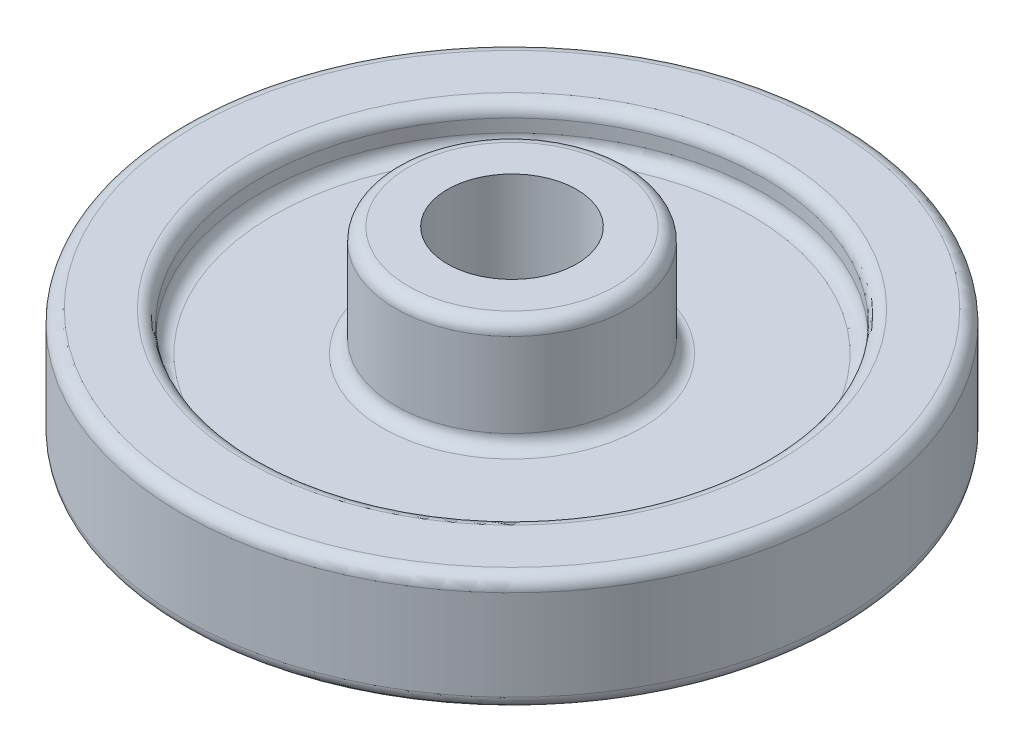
ISO-10303-21;
HEADER;
FILE_DESCRIPTION(('STEP AP214'),'2;1');
FILE_NAME('part.step','',(''),(''),'','','');
FILE_SCHEMA(('AUTOMOTIVE_DESIGN { 1 0 10303 214 1 1 1 1 }'));
ENDSEC;
DATA;
#1=APPLICATION_CONTEXT('core data for automotive mechanical design processes');
#2=APPLICATION_PROTOCOL_DEFINITION('international standard','automotive_design',2000,#1);
#3=PRODUCT_CONTEXT('',#1,'mechanical');
#4=PRODUCT('Part','Part','',(#3));
#5=PRODUCT_RELATED_PRODUCT_CATEGORY('part','',(#4));
#6=PRODUCT_DEFINITION_FORMATION('','',#4);
#7=PRODUCT_DEFINITION_CONTEXT('part definition',#1,'design');
#8=PRODUCT_DEFINITION('design','',#6,#7);
#9=PRODUCT_DEFINITION_SHAPE('','',#8);
#10=(LENGTH_UNIT() NAMED_UNIT(*) SI_UNIT(.MILLI.,.METRE.));
#11=(NAMED_UNIT(*) PLANE_ANGLE_UNIT() SI_UNIT($,.RADIAN.));
#12=(NAMED_UNIT(*) SI_UNIT($,.STERADIAN.) SOLID_ANGLE_UNIT());
#13=UNCERTAINTY_MEASURE_WITH_UNIT(LENGTH_MEASURE(1.E-05),#10,'distance_accuracy_value','');
#14=(GEOMETRIC_REPRESENTATION_CONTEXT(3) GLOBAL_UNCERTAINTY_ASSIGNED_CONTEXT((#13)) GLOBAL_UNIT_ASSIGNED_CONTEXT((#10,
#11,#12)) REPRESENTATION_CONTEXT('',''));
#15=CARTESIAN_POINT('',(0.,0.,0.));
#16=DIRECTION('',(0.,0.,1.));
#17=DIRECTION('',(1.,0.,0.));
#18=AXIS2_PLACEMENT_3D('',#15,#16,#17);
#19=CARTESIAN_POINT('',(28.575,0.,0.));
#20=DIRECTION('',(0.,1.,0.));
#21=DIRECTION('',(0.,0.,1.));
#22=AXIS2_PLACEMENT_3D('',#19,#20,#21);
#23=PLANE('',#22);
#24=CARTESIAN_POINT('',(0.,0.,0.));
#25=DIRECTION('',(0.,-1.,0.));
#26=DIRECTION('',(0.,0.,-1.));
#27=AXIS2_PLACEMENT_3D('',#24,#25,#26);
#28=CIRCLE('',#27,15.875);
#29=CARTESIAN_POINT('',(0.,0.,-15.875));
#30=VERTEX_POINT('',#29);
#31=EDGE_CURVE('E93',#30,#30,#28,.T.);
#32=ORIENTED_EDGE('',*,*,#31,.F.);
#33=EDGE_LOOP('',(#32));
#34=FACE_BOUND('',#33,.T.);
#35=CARTESIAN_POINT('',(0.,0.,0.));
#36=DIRECTION('',(0.,-1.,0.));
#37=DIRECTION('',(0.,0.,-1.));
#38=AXIS2_PLACEMENT_3D('',#35,#36,#37);
#39=CIRCLE('',#38,28.575);
#40=CARTESIAN_POINT('',(0.,0.,-28.575));
#41=VERTEX_POINT('',#40);
#42=EDGE_CURVE('E10',#41,#41,#39,.T.);
#43=ORIENTED_EDGE('',*,*,#42,.T.);
#44=EDGE_LOOP('',(#43));
#45=FACE_BOUND('',#44,.T.);
#46=ADVANCED_FACE('F26',(#34,#45),#23,.F.);
#47=CARTESIAN_POINT('',(0.,0.,0.));
#48=DIRECTION('',(0.,-1.,0.));
#49=DIRECTION('',(0.,0.,-1.));
#50=AXIS2_PLACEMENT_3D('',#47,#48,#49);
#51=CYLINDRICAL_SURFACE('',#50,28.575);
#52=CARTESIAN_POINT('',(0.,6.34999999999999,0.));
#53=DIRECTION('',(0.,-1.,0.));
#54=DIRECTION('',(0.,0.,-1.));
#55=AXIS2_PLACEMENT_3D('',#52,#53,#54);
#56=CIRCLE('',#55,28.575);
#57=CARTESIAN_POINT('',(0.,6.34999999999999,-28.575));
#58=VERTEX_POINT('',#57);
#59=EDGE_CURVE('E32',#58,#58,#56,.T.);
#60=ORIENTED_EDGE('',*,*,#59,.T.);
#61=EDGE_LOOP('',(#60));
#62=FACE_BOUND('',#61,.T.);
#63=ORIENTED_EDGE('',*,*,#42,.F.);
#64=EDGE_LOOP('',(#63));
#65=FACE_BOUND('',#64,.T.);
#66=ADVANCED_FACE('F100',(#62,#65),#51,.T.);
#67=CARTESIAN_POINT('',(0.,6.35000000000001,0.));
#68=DIRECTION('',(0.,-1.,0.));
#69=DIRECTION('',(0.,0.,-1.));
#70=AXIS2_PLACEMENT_3D('',#67,#68,#69);
#71=TOROIDAL_SURFACE('',#70,31.75,3.175);
#72=ORIENTED_EDGE('',*,*,#59,.F.);
#73=EDGE_LOOP('',(#72));
#74=FACE_BOUND('',#73,.T.);
#75=CARTESIAN_POINT('',(0.,9.52500000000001,0.));
#76=DIRECTION('',(0.,-1.,0.));
#77=DIRECTION('',(0.,0.,-1.));
#78=AXIS2_PLACEMENT_3D('',#75,#76,#77);
#79=CIRCLE('',#78,31.75);
#80=CARTESIAN_POINT('',(0.,9.52500000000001,-31.75));
#81=VERTEX_POINT('',#80);
#82=EDGE_CURVE('E36',#81,#81,#79,.T.);
#83=ORIENTED_EDGE('',*,*,#82,.T.);
#84=EDGE_LOOP('',(#83));
#85=FACE_BOUND('',#84,.T.);
#86=ADVANCED_FACE('F104',(#74,#85),#71,.F.);
#87=CARTESIAN_POINT('',(31.75,9.52500000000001,0.));
#88=DIRECTION('',(0.,-1.,0.));
#89=DIRECTION('',(0.,0.,-1.));
#90=AXIS2_PLACEMENT_3D('',#87,#88,#89);
#91=PLANE('',#90);
#92=CARTESIAN_POINT('',(0.,9.52500000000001,0.));
#93=DIRECTION('',(0.,-1.,0.));
#94=DIRECTION('',(0.,0.,-1.));
#95=AXIS2_PLACEMENT_3D('',#92,#93,#94);
#96=CIRCLE('',#95,58.7375);
#97=CARTESIAN_POINT('',(0.,9.52500000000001,-58.7375));
#98=VERTEX_POINT('',#97);
#99=EDGE_CURVE('E40',#98,#98,#96,.T.);
#100=ORIENTED_EDGE('',*,*,#99,.T.);
#101=EDGE_LOOP('',(#100));
#102=FACE_BOUND('',#101,.T.);
#103=ORIENTED_EDGE('',*,*,#82,.F.);
#104=EDGE_LOOP('',(#103));
#105=FACE_BOUND('',#104,.T.);
#106=ADVANCED_FACE('F108',(#102,#105),#91,.T.);
#107=CARTESIAN_POINT('',(0.,6.35000000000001,0.));
#108=DIRECTION('',(0.,-1.,0.));
#109=DIRECTION('',(0.,0.,-1.));
#110=AXIS2_PLACEMENT_3D('',#107,#108,#109);
#111=TOROIDAL_SURFACE('',#110,58.7375,3.175);
#112=ORIENTED_EDGE('',*,*,#99,.F.);
#113=EDGE_LOOP('',(#112));
#114=FACE_BOUND('',#113,.T.);
#115=CARTESIAN_POINT('',(0.,6.34999999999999,0.));
#116=DIRECTION('',(0.,-1.,0.));
#117=DIRECTION('',(0.,0.,-1.));
#118=AXIS2_PLACEMENT_3D('',#115,#116,#117);
#119=CIRCLE('',#118,61.9125);
#120=CARTESIAN_POINT('',(0.,6.34999999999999,-61.9125));
#121=VERTEX_POINT('',#120);
#122=EDGE_CURVE('E45',#121,#121,#119,.T.);
#123=ORIENTED_EDGE('',*,*,#122,.T.);
#124=EDGE_LOOP('',(#123));
#125=FACE_BOUND('',#124,.T.);
#126=ADVANCED_FACE('F115',(#114,#125),#111,.F.);
#127=CARTESIAN_POINT('',(0.,0.,0.));
#128=DIRECTION('',(0.,-1.,0.));
#129=DIRECTION('',(0.,0.,-1.));
#130=AXIS2_PLACEMENT_3D('',#127,#128,#129);
#131=CYLINDRICAL_SURFACE('',#130,61.9125);
#132=CARTESIAN_POINT('',(0.,3.17500000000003,0.));
#133=DIRECTION('',(0.,-1.,0.));
#134=DIRECTION('',(0.,0.,-1.));
#135=AXIS2_PLACEMENT_3D('',#132,#133,#134);
#136=CIRCLE('',#135,61.9125);
#137=CARTESIAN_POINT('',(0.,3.17500000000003,-61.9125));
#138=VERTEX_POINT('',#137);
#139=EDGE_CURVE('E48',#138,#138,#136,.T.);
#140=ORIENTED_EDGE('',*,*,#139,.T.);
#141=EDGE_LOOP('',(#140));
#142=FACE_BOUND('',#141,.T.);
#143=ORIENTED_EDGE('',*,*,#122,.F.);
#144=EDGE_LOOP('',(#143));
#145=FACE_BOUND('',#144,.T.);
#146=ADVANCED_FACE('F119',(#142,#145),#131,.F.);
#147=CARTESIAN_POINT('',(0.,3.175,0.));
#148=DIRECTION('',(0.,-1.,0.));
#149=DIRECTION('',(0.,0.,-1.));
#150=AXIS2_PLACEMENT_3D('',#147,#148,#149);
#151=TOROIDAL_SURFACE('',#150,65.0875,3.175);
#152=ORIENTED_EDGE('',*,*,#139,.F.);
#153=EDGE_LOOP('',(#152));
#154=FACE_BOUND('',#153,.T.);
#155=CARTESIAN_POINT('',(0.,0.,0.));
#156=DIRECTION('',(0.,-1.,0.));
#157=DIRECTION('',(0.,0.,-1.));
#158=AXIS2_PLACEMENT_3D('',#155,#156,#157);
#159=CIRCLE('',#158,65.0875);
#160=CARTESIAN_POINT('',(0.,0.,-65.0875));
#161=VERTEX_POINT('',#160);
#162=EDGE_CURVE('E51',#161,#161,#159,.T.);
#163=ORIENTED_EDGE('',*,*,#162,.T.);
#164=EDGE_LOOP('',(#163));
#165=FACE_BOUND('',#164,.T.);
#166=ADVANCED_FACE('F123',(#154,#165),#151,.T.);
#167=CARTESIAN_POINT('',(77.7875,0.,0.));
#168=DIRECTION('',(0.,1.,0.));
#169=DIRECTION('',(0.,0.,1.));
#170=AXIS2_PLACEMENT_3D('',#167,#168,#169);
#171=PLANE('',#170);
#172=ORIENTED_EDGE('',*,*,#162,.F.);
#173=EDGE_LOOP('',(#172));
#174=FACE_BOUND('',#173,.T.);
#175=CARTESIAN_POINT('',(0.,0.,0.));
#176=DIRECTION('',(0.,-1.,0.));
#177=DIRECTION('',(0.,0.,-1.));
#178=AXIS2_PLACEMENT_3D('',#175,#176,#177);
#179=CIRCLE('',#178,77.7875);
#180=CARTESIAN_POINT('',(0.,0.,-77.7875));
#181=VERTEX_POINT('',#180);
#182=EDGE_CURVE('E54',#181,#181,#179,.T.);
#183=ORIENTED_EDGE('',*,*,#182,.T.);
#184=EDGE_LOOP('',(#183));
#185=FACE_BOUND('',#184,.T.);
#186=ADVANCED_FACE('F127',(#174,#185),#171,.F.);
#187=CARTESIAN_POINT('',(0.,3.175,0.));
#188=DIRECTION('',(0.,-1.,0.));
#189=DIRECTION('',(0.,0.,-1.));
#190=AXIS2_PLACEMENT_3D('',#187,#188,#189);
#191=TOROIDAL_SURFACE('',#190,77.7875,3.175);
#192=CARTESIAN_POINT('',(0.,3.17500000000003,0.));
#193=DIRECTION('',(0.,-1.,0.));
#194=DIRECTION('',(0.,0.,-1.));
#195=AXIS2_PLACEMENT_3D('',#192,#193,#194);
#196=CIRCLE('',#195,80.9625);
#197=CARTESIAN_POINT('',(0.,3.17500000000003,-80.9625));
#198=VERTEX_POINT('',#197);
#199=EDGE_CURVE('E57',#198,#198,#196,.T.);
#200=ORIENTED_EDGE('',*,*,#199,.T.);
#201=EDGE_LOOP('',(#200));
#202=FACE_BOUND('',#201,.T.);
#203=ORIENTED_EDGE('',*,*,#182,.F.);
#204=EDGE_LOOP('',(#203));
#205=FACE_BOUND('',#204,.T.);
#206=ADVANCED_FACE('F131',(#202,#205),#191,.T.);
#207=CARTESIAN_POINT('',(0.,0.,0.));
#208=DIRECTION('',(0.,-1.,0.));
#209=DIRECTION('',(0.,0.,-1.));
#210=AXIS2_PLACEMENT_3D('',#207,#208,#209);
#211=CYLINDRICAL_SURFACE('',#210,80.9625);
#212=ORIENTED_EDGE('',*,*,#199,.F.);
#213=EDGE_LOOP('',(#212));
#214=FACE_BOUND('',#213,.T.);
#215=CARTESIAN_POINT('',(0.,25.4,0.));
#216=DIRECTION('',(0.,-1.,0.));
#217=DIRECTION('',(0.,0.,-1.));
#218=AXIS2_PLACEMENT_3D('',#215,#216,#217);
#219=CIRCLE('',#218,80.9625);
#220=CARTESIAN_POINT('',(0.,25.4,-80.9625));
#221=VERTEX_POINT('',#220);
#222=EDGE_CURVE('E60',#221,#221,#219,.T.);
#223=ORIENTED_EDGE('',*,*,#222,.T.);
#224=EDGE_LOOP('',(#223));
#225=FACE_BOUND('',#224,.T.);
#226=ADVANCED_FACE('F135',(#214,#225),#211,.T.);
#227=CARTESIAN_POINT('',(0.,25.4,0.));
#228=DIRECTION('',(0.,-1.,0.));
#229=DIRECTION('',(0.,0.,-1.));
#230=AXIS2_PLACEMENT_3D('',#227,#228,#229);
#231=TOROIDAL_SURFACE('',#230,77.7875,3.175);
#232=CARTESIAN_POINT('',(0.,28.575,0.));
#233=DIRECTION('',(0.,-1.,0.));
#234=DIRECTION('',(0.,0.,-1.));
#235=AXIS2_PLACEMENT_3D('',#232,#233,#234);
#236=CIRCLE('',#235,77.7875);
#237=CARTESIAN_POINT('',(0.,28.575,-77.7875));
#238=VERTEX_POINT('',#237);
#239=EDGE_CURVE('E63',#238,#238,#236,.T.);
#240=ORIENTED_EDGE('',*,*,#239,.T.);
#241=EDGE_LOOP('',(#240));
#242=FACE_BOUND('',#241,.T.);
#243=ORIENTED_EDGE('',*,*,#222,.F.);
#244=EDGE_LOOP('',(#243));
#245=FACE_BOUND('',#244,.T.);
#246=ADVANCED_FACE('F139',(#242,#245),#231,.T.);
#247=CARTESIAN_POINT('',(65.0875,28.575,0.));
#248=DIRECTION('',(0.,-1.,0.));
#249=DIRECTION('',(0.,0.,-1.));
#250=AXIS2_PLACEMENT_3D('',#247,#248,#249);
#251=PLANE('',#250);
#252=ORIENTED_EDGE('',*,*,#239,.F.);
#253=EDGE_LOOP('',(#252));
#254=FACE_BOUND('',#253,.T.);
#255=CARTESIAN_POINT('',(0.,28.575,0.));
#256=DIRECTION('',(0.,-1.,0.));
#257=DIRECTION('',(0.,0.,-1.));
#258=AXIS2_PLACEMENT_3D('',#255,#256,#257);
#259=CIRCLE('',#258,65.0875);
#260=CARTESIAN_POINT('',(0.,28.575,-65.0875));
#261=VERTEX_POINT('',#260);
#262=EDGE_CURVE('E66',#261,#261,#259,.T.);
#263=ORIENTED_EDGE('',*,*,#262,.T.);
#264=EDGE_LOOP('',(#263));
#265=FACE_BOUND('',#264,.T.);
#266=ADVANCED_FACE('F143',(#254,#265),#251,.F.);
#267=CARTESIAN_POINT('',(0.,25.4,0.));
#268=DIRECTION('',(0.,-1.,0.));
#269=DIRECTION('',(0.,0.,-1.));
#270=AXIS2_PLACEMENT_3D('',#267,#268,#269);
#271=TOROIDAL_SURFACE('',#270,65.0875,3.175);
#272=CARTESIAN_POINT('',(0.,25.4,0.));
#273=DIRECTION('',(0.,-1.,0.));
#274=DIRECTION('',(0.,0.,-1.));
#275=AXIS2_PLACEMENT_3D('',#272,#273,#274);
#276=CIRCLE('',#275,61.9125);
#277=CARTESIAN_POINT('',(0.,25.4,-61.9125));
#278=VERTEX_POINT('',#277);
#279=EDGE_CURVE('E69',#278,#278,#276,.T.);
#280=ORIENTED_EDGE('',*,*,#279,.T.);
#281=EDGE_LOOP('',(#280));
#282=FACE_BOUND('',#281,.T.);
#283=ORIENTED_EDGE('',*,*,#262,.F.);
#284=EDGE_LOOP('',(#283));
#285=FACE_BOUND('',#284,.T.);
#286=ADVANCED_FACE('F147',(#282,#285),#271,.T.);
#287=CARTESIAN_POINT('',(0.,0.,0.));
#288=DIRECTION('',(0.,-1.,0.));
#289=DIRECTION('',(0.,0.,-1.));
#290=AXIS2_PLACEMENT_3D('',#287,#288,#289);
#291=CYLINDRICAL_SURFACE('',#290,61.9125);
#292=ORIENTED_EDGE('',*,*,#279,.F.);
#293=EDGE_LOOP('',(#292));
#294=FACE_BOUND('',#293,.T.);
#295=CARTESIAN_POINT('',(0.,22.225,0.));
#296=DIRECTION('',(0.,-1.,0.));
#297=DIRECTION('',(0.,0.,-1.));
#298=AXIS2_PLACEMENT_3D('',#295,#296,#297);
#299=CIRCLE('',#298,61.9125);
#300=CARTESIAN_POINT('',(0.,22.225,-61.9125));
#301=VERTEX_POINT('',#300);
#302=EDGE_CURVE('E72',#301,#301,#299,.T.);
#303=ORIENTED_EDGE('',*,*,#302,.T.);
#304=EDGE_LOOP('',(#303));
#305=FACE_BOUND('',#304,.T.);
#306=ADVANCED_FACE('F151',(#294,#305),#291,.F.);
#307=CARTESIAN_POINT('',(0.,22.225,0.));
#308=DIRECTION('',(0.,-1.,0.));
#309=DIRECTION('',(0.,0.,-1.));
#310=AXIS2_PLACEMENT_3D('',#307,#308,#309);
#311=TOROIDAL_SURFACE('',#310,58.7375,3.175);
#312=CARTESIAN_POINT('',(0.,19.05,0.));
#313=DIRECTION('',(0.,-1.,0.));
#314=DIRECTION('',(0.,0.,-1.));
#315=AXIS2_PLACEMENT_3D('',#312,#313,#314);
#316=CIRCLE('',#315,58.7375);
#317=CARTESIAN_POINT('',(0.,19.05,-58.7375));
#318=VERTEX_POINT('',#317);
#319=EDGE_CURVE('E75',#318,#318,#316,.T.);
#320=ORIENTED_EDGE('',*,*,#319,.T.);
#321=EDGE_LOOP('',(#320));
#322=FACE_BOUND('',#321,.T.);
#323=ORIENTED_EDGE('',*,*,#302,.F.);
#324=EDGE_LOOP('',(#323));
#325=FACE_BOUND('',#324,.T.);
#326=ADVANCED_FACE('F155',(#322,#325),#311,.F.);
#327=CARTESIAN_POINT('',(31.75,19.05,0.));
#328=DIRECTION('',(0.,-1.,0.));
#329=DIRECTION('',(0.,0.,-1.));
#330=AXIS2_PLACEMENT_3D('',#327,#328,#329);
#331=PLANE('',#330);
#332=ORIENTED_EDGE('',*,*,#319,.F.);
#333=EDGE_LOOP('',(#332));
#334=FACE_BOUND('',#333,.T.);
#335=CARTESIAN_POINT('',(0.,19.05,0.));
#336=DIRECTION('',(0.,-1.,0.));
#337=DIRECTION('',(0.,0.,-1.));
#338=AXIS2_PLACEMENT_3D('',#335,#336,#337);
#339=CIRCLE('',#338,31.75);
#340=CARTESIAN_POINT('',(0.,19.05,-31.75));
#341=VERTEX_POINT('',#340);
#342=EDGE_CURVE('E78',#341,#341,#339,.T.);
#343=ORIENTED_EDGE('',*,*,#342,.T.);
#344=EDGE_LOOP('',(#343));
#345=FACE_BOUND('',#344,.T.);
#346=ADVANCED_FACE('F159',(#334,#345),#331,.F.);
#347=CARTESIAN_POINT('',(0.,22.225,0.));
#348=DIRECTION('',(0.,-1.,0.));
#349=DIRECTION('',(0.,0.,-1.));
#350=AXIS2_PLACEMENT_3D('',#347,#348,#349);
#351=TOROIDAL_SURFACE('',#350,31.75,3.175);
#352=CARTESIAN_POINT('',(0.,22.225,0.));
#353=DIRECTION('',(0.,-1.,0.));
#354=DIRECTION('',(0.,0.,-1.));
#355=AXIS2_PLACEMENT_3D('',#352,#353,#354);
#356=CIRCLE('',#355,28.575);
#357=CARTESIAN_POINT('',(0.,22.225,-28.575));
#358=VERTEX_POINT('',#357);
#359=EDGE_CURVE('E81',#358,#358,#356,.T.);
#360=ORIENTED_EDGE('',*,*,#359,.T.);
#361=EDGE_LOOP('',(#360));
#362=FACE_BOUND('',#361,.T.);
#363=ORIENTED_EDGE('',*,*,#342,.F.);
#364=EDGE_LOOP('',(#363));
#365=FACE_BOUND('',#364,.T.);
#366=ADVANCED_FACE('F163',(#362,#365),#351,.F.);
#367=CARTESIAN_POINT('',(0.,0.,0.));
#368=DIRECTION('',(0.,-1.,0.));
#369=DIRECTION('',(0.,0.,-1.));
#370=AXIS2_PLACEMENT_3D('',#367,#368,#369);
#371=CYLINDRICAL_SURFACE('',#370,28.575);
#372=ORIENTED_EDGE('',*,*,#359,.F.);
#373=EDGE_LOOP('',(#372));
#374=FACE_BOUND('',#373,.T.);
#375=CARTESIAN_POINT('',(0.,42.8752,0.));
#376=DIRECTION('',(0.,-1.,0.));
#377=DIRECTION('',(0.,0.,-1.));
#378=AXIS2_PLACEMENT_3D('',#375,#376,#377);
#379=CIRCLE('',#378,28.575);
#380=CARTESIAN_POINT('',(0.,42.8752,-28.575));
#381=VERTEX_POINT('',#380);
#382=EDGE_CURVE('E84',#381,#381,#379,.T.);
#383=ORIENTED_EDGE('',*,*,#382,.T.);
#384=EDGE_LOOP('',(#383));
#385=FACE_BOUND('',#384,.T.);
#386=ADVANCED_FACE('F167',(#374,#385),#371,.T.);
#387=CARTESIAN_POINT('',(0.,42.8752,0.));
#388=DIRECTION('',(0.,-1.,0.));
#389=DIRECTION('',(0.,0.,-1.));
#390=AXIS2_PLACEMENT_3D('',#387,#388,#389);
#391=TOROIDAL_SURFACE('',#390,25.4,3.175);
#392=CARTESIAN_POINT('',(0.,46.0502,0.));
#393=DIRECTION('',(0.,-1.,0.));
#394=DIRECTION('',(0.,0.,-1.));
#395=AXIS2_PLACEMENT_3D('',#392,#393,#394);
#396=CIRCLE('',#395,25.4);
#397=CARTESIAN_POINT('',(0.,46.0502,-25.4));
#398=VERTEX_POINT('',#397);
#399=EDGE_CURVE('E87',#398,#398,#396,.T.);
#400=ORIENTED_EDGE('',*,*,#399,.T.);
#401=EDGE_LOOP('',(#400));
#402=FACE_BOUND('',#401,.T.);
#403=ORIENTED_EDGE('',*,*,#382,.F.);
#404=EDGE_LOOP('',(#403));
#405=FACE_BOUND('',#404,.T.);
#406=ADVANCED_FACE('F171',(#402,#405),#391,.T.);
#407=CARTESIAN_POINT('',(15.875,46.0502,0.));
#408=DIRECTION('',(0.,-1.,0.));
#409=DIRECTION('',(0.,0.,-1.));
#410=AXIS2_PLACEMENT_3D('',#407,#408,#409);
#411=PLANE('',#410);
#412=ORIENTED_EDGE('',*,*,#399,.F.);
#413=EDGE_LOOP('',(#412));
#414=FACE_BOUND('',#413,.T.);
#415=CARTESIAN_POINT('',(0.,46.0502,0.));
#416=DIRECTION('',(0.,-1.,0.));
#417=DIRECTION('',(0.,0.,-1.));
#418=AXIS2_PLACEMENT_3D('',#415,#416,#417);
#419=CIRCLE('',#418,15.875);
#420=CARTESIAN_POINT('',(0.,46.0502,-15.875));
#421=VERTEX_POINT('',#420);
#422=EDGE_CURVE('E90',#421,#421,#419,.T.);
#423=ORIENTED_EDGE('',*,*,#422,.T.);
#424=EDGE_LOOP('',(#423));
#425=FACE_BOUND('',#424,.T.);
#426=ADVANCED_FACE('F175',(#414,#425),#411,.F.);
#427=CARTESIAN_POINT('',(0.,0.,0.));
#428=DIRECTION('',(0.,-1.,0.));
#429=DIRECTION('',(0.,0.,-1.));
#430=AXIS2_PLACEMENT_3D('',#427,#428,#429);
#431=CYLINDRICAL_SURFACE('',#430,15.875);
#432=ORIENTED_EDGE('',*,*,#422,.F.);
#433=EDGE_LOOP('',(#432));
#434=FACE_BOUND('',#433,.T.);
#435=ORIENTED_EDGE('',*,*,#31,.T.);
#436=EDGE_LOOP('',(#435));
#437=FACE_BOUND('',#436,.T.);
#438=ADVANCED_FACE('F97',(#434,#437),#431,.F.);
#439=CLOSED_SHELL('',(#46,#66,#86,#106,#126,#146,#166,#186,#206,#226,#246,#266,#286,#306,#326,
#346,#366,#386,#406,#426,#438));
#440=MANIFOLD_SOLID_BREP('B2',#439);
#441=ADVANCED_BREP_SHAPE_REPRESENTATION('',(#18,#440),#14);
#442=SHAPE_DEFINITION_REPRESENTATION(#9,#441);
ENDSEC;
END-ISO-10303-21;
